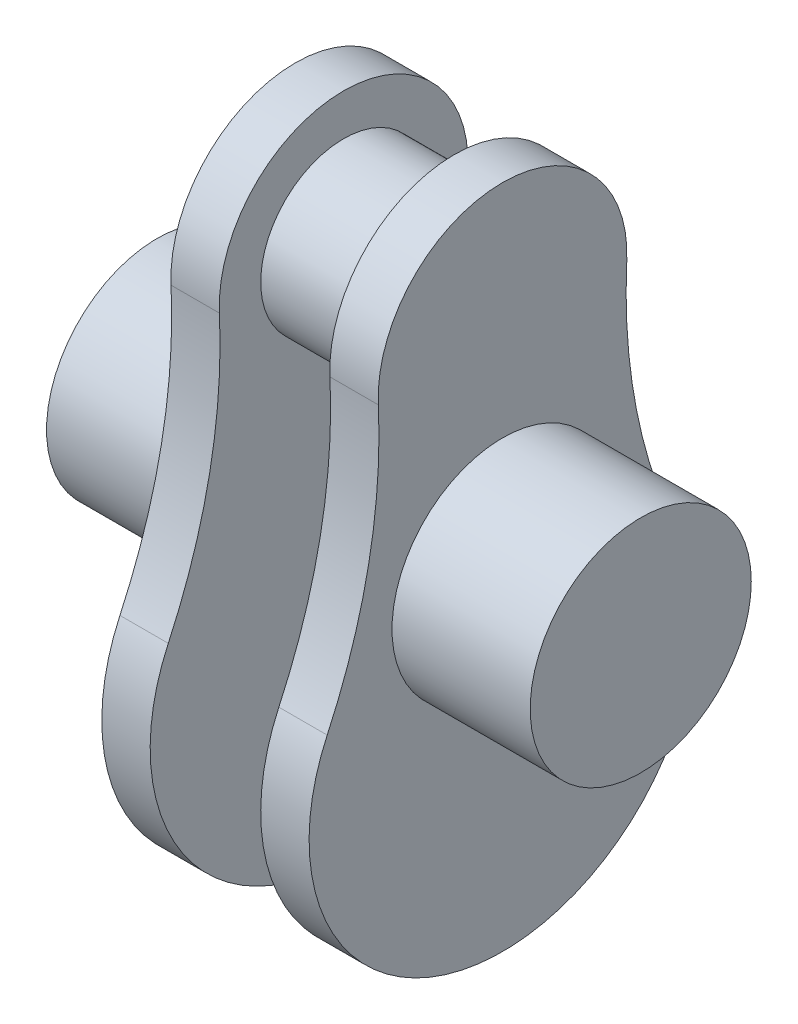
from build123d import *

# Parameters (mm, degrees)
SZKIC2_R          = 40
CZOP_WA_U_DEPTH   = 50
SZKIC3_R          = 30
WYKORBIENIE_DEPTH = 20
PRZECIWWAGA_DEPTH = 17.5


with BuildPart() as part:
    # Szkic2 → Czop wa_u (new body)
    with BuildSketch(Plane(origin=(-87.5, 0, 0), x_dir=(0, 0, -1), z_dir=(1, 0, 0))):
        Circle(SZKIC2_R)
    czop_wa_u = extrude(amount=CZOP_WA_U_DEPTH)



with BuildPart() as body_2:
    # Szkic3 → Wykorbienie (new, symmetric)
    with BuildSketch(Plane(origin=(0, 0, 0), x_dir=(0, 0, -1), z_dir=(1, 0, 0))):
        with Locations((0, 75)):
            Circle(SZKIC3_R)
    extrude(amount=WYKORBIENIE_DEPTH, both=True)


with BuildPart() as part_1:
    add(part.part)

    add(body_2.part)  # Przeciwwaga merges body 2
    # Szkic4 → Przeciwwaga (add)
    with BuildSketch(Plane(origin=(-37.5, 0, 0), x_dir=(0, 0, -1), z_dir=(1, 0, 0))):
        with BuildLine():
            ThreePointArc((44.946809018, 72.812682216), (0, 120), (-44.946809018, 72.812682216))
            ThreePointArc((-44.946809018, 72.812682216), (-48.455318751, 24.569311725), (-63.443438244, -21.420781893))
            ThreePointArc((-63.443438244, -21.420781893), (0, -121), (63.443438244, -21.420781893))
            ThreePointArc((63.443438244, -21.420781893), (48.455318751, 24.569311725), (44.946809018, 72.812682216))
        make_face()
    przeciwwaga = extrude(amount=PRZECIWWAGA_DEPTH)

    # Lustro2: Czop wa_u, Przeciwwaga across plane
    add(czop_wa_u.mirror(Plane(origin=(0, 0, 0), x_dir=(0, 0, 1), z_dir=(1, 0, 0))))
    add(przeciwwaga.mirror(Plane(origin=(0, 0, 0), x_dir=(0, 0, 1), z_dir=(1, 0, 0))))


solid = part_1.part
